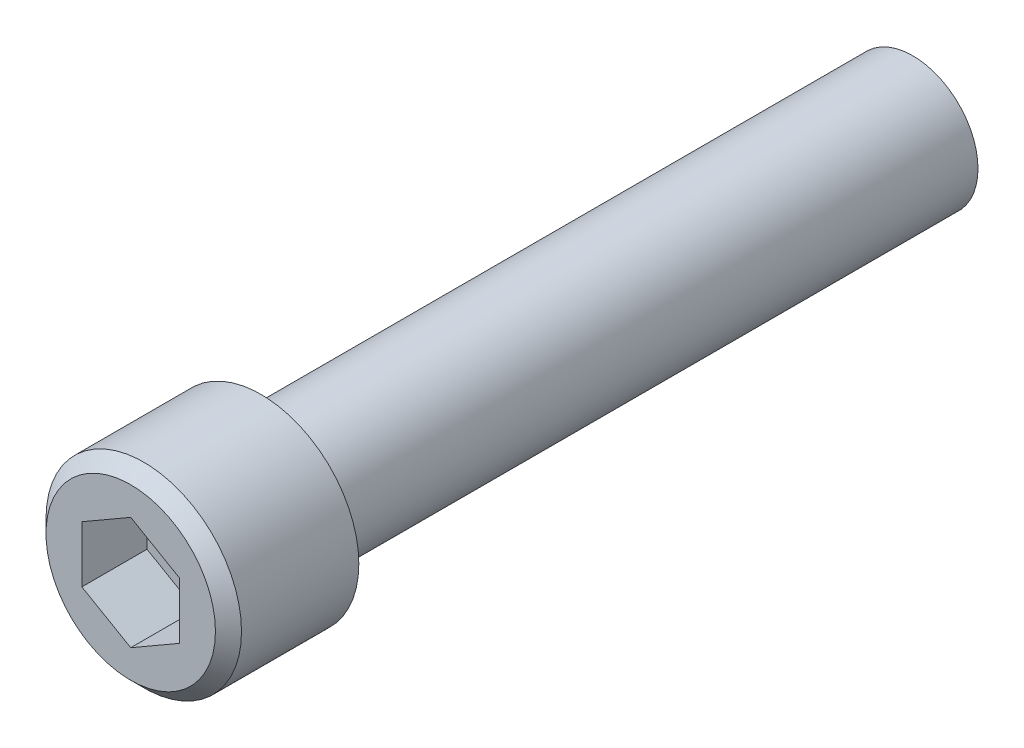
ISO-10303-21;
HEADER;
FILE_DESCRIPTION(('STEP AP214'),'2;1');
FILE_NAME('part.step','',(''),(''),'','','');
FILE_SCHEMA(('AUTOMOTIVE_DESIGN { 1 0 10303 214 1 1 1 1 }'));
ENDSEC;
DATA;
#1=APPLICATION_CONTEXT('core data for automotive mechanical design processes');
#2=APPLICATION_PROTOCOL_DEFINITION('international standard','automotive_design',2000,#1);
#3=PRODUCT_CONTEXT('',#1,'mechanical');
#4=PRODUCT('Part','Part','',(#3));
#5=PRODUCT_RELATED_PRODUCT_CATEGORY('part','',(#4));
#6=PRODUCT_DEFINITION_FORMATION('','',#4);
#7=PRODUCT_DEFINITION_CONTEXT('part definition',#1,'design');
#8=PRODUCT_DEFINITION('design','',#6,#7);
#9=PRODUCT_DEFINITION_SHAPE('','',#8);
#10=(LENGTH_UNIT() NAMED_UNIT(*) SI_UNIT(.MILLI.,.METRE.));
#11=(NAMED_UNIT(*) PLANE_ANGLE_UNIT() SI_UNIT($,.RADIAN.));
#12=(NAMED_UNIT(*) SI_UNIT($,.STERADIAN.) SOLID_ANGLE_UNIT());
#13=UNCERTAINTY_MEASURE_WITH_UNIT(LENGTH_MEASURE(1.E-05),#10,'distance_accuracy_value','');
#14=(GEOMETRIC_REPRESENTATION_CONTEXT(3) GLOBAL_UNCERTAINTY_ASSIGNED_CONTEXT((#13)) GLOBAL_UNIT_ASSIGNED_CONTEXT((#10,
#11,#12)) REPRESENTATION_CONTEXT('',''));
#15=CARTESIAN_POINT('',(0.,0.,0.));
#16=DIRECTION('',(0.,0.,1.));
#17=DIRECTION('',(1.,0.,0.));
#18=AXIS2_PLACEMENT_3D('',#15,#16,#17);
#19=CARTESIAN_POINT('',(0.,0.,31.75));
#20=DIRECTION('',(0.,0.,-1.));
#21=DIRECTION('',(-1.,0.,0.));
#22=AXIS2_PLACEMENT_3D('',#19,#20,#21);
#23=CYLINDRICAL_SURFACE('',#22,3.175);
#24=CARTESIAN_POINT('',(0.,0.,31.3944));
#25=DIRECTION('',(0.,0.,1.));
#26=DIRECTION('',(1.,0.,0.));
#27=AXIS2_PLACEMENT_3D('',#24,#25,#26);
#28=CIRCLE('',#27,3.175);
#29=CARTESIAN_POINT('',(3.175,0.,31.3944));
#30=VERTEX_POINT('',#29);
#31=EDGE_CURVE('E143',#30,#30,#28,.F.);
#32=ORIENTED_EDGE('',*,*,#31,.T.);
#33=EDGE_LOOP('',(#32));
#34=FACE_BOUND('',#33,.T.);
#35=CARTESIAN_POINT('',(0.,0.,0.));
#36=DIRECTION('',(0.,0.,1.));
#37=DIRECTION('',(1.,0.,0.));
#38=AXIS2_PLACEMENT_3D('',#35,#36,#37);
#39=CIRCLE('',#38,3.175);
#40=CARTESIAN_POINT('',(3.175,0.,0.));
#41=VERTEX_POINT('',#40);
#42=EDGE_CURVE('E137',#41,#41,#39,.T.);
#43=ORIENTED_EDGE('',*,*,#42,.T.);
#44=EDGE_LOOP('',(#43));
#45=FACE_BOUND('',#44,.T.);
#46=ADVANCED_FACE('F30',(#34,#45),#23,.T.);
#47=CARTESIAN_POINT('',(0.,0.,0.));
#48=DIRECTION('',(0.,0.,1.));
#49=DIRECTION('',(1.,0.,0.));
#50=AXIS2_PLACEMENT_3D('',#47,#48,#49);
#51=PLANE('',#50);
#52=ORIENTED_EDGE('',*,*,#42,.F.);
#53=EDGE_LOOP('',(#52));
#54=FACE_BOUND('',#53,.T.);
#55=ADVANCED_FACE('F161',(#54),#51,.F.);
#56=CARTESIAN_POINT('',(0.,0.,31.75));
#57=DIRECTION('',(0.,0.,1.));
#58=DIRECTION('',(1.,0.,0.));
#59=AXIS2_PLACEMENT_3D('',#56,#57,#58);
#60=PLANE('',#59);
#61=CARTESIAN_POINT('',(0.,0.,31.75));
#62=DIRECTION('',(0.,0.,1.));
#63=DIRECTION('',(1.,0.,0.));
#64=AXIS2_PLACEMENT_3D('',#61,#62,#63);
#65=CIRCLE('',#64,3.5306);
#66=CARTESIAN_POINT('',(3.5306,0.,31.75));
#67=VERTEX_POINT('',#66);
#68=EDGE_CURVE('E140',#67,#67,#65,.T.);
#69=ORIENTED_EDGE('',*,*,#68,.T.);
#70=EDGE_LOOP('',(#69));
#71=FACE_BOUND('',#70,.T.);
#72=CARTESIAN_POINT('',(0.,0.,31.75));
#73=DIRECTION('',(0.,0.,1.));
#74=DIRECTION('',(1.,0.,0.));
#75=AXIS2_PLACEMENT_3D('',#72,#73,#74);
#76=CIRCLE('',#75,4.7625);
#77=CARTESIAN_POINT('',(4.7625,0.,31.75));
#78=VERTEX_POINT('',#77);
#79=EDGE_CURVE('E128',#78,#78,#76,.T.);
#80=ORIENTED_EDGE('',*,*,#79,.F.);
#81=EDGE_LOOP('',(#80));
#82=FACE_BOUND('',#81,.T.);
#83=ADVANCED_FACE('F166',(#71,#82),#60,.F.);
#84=CARTESIAN_POINT('',(0.,0.,38.1));
#85=DIRECTION('',(0.,0.,-1.));
#86=DIRECTION('',(-1.,0.,0.));
#87=AXIS2_PLACEMENT_3D('',#84,#85,#86);
#88=CYLINDRICAL_SURFACE('',#87,4.7625);
#89=CARTESIAN_POINT('',(0.,0.,37.4649999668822));
#90=DIRECTION('',(0.,0.,1.));
#91=DIRECTION('',(1.,0.,0.));
#92=AXIS2_PLACEMENT_3D('',#89,#90,#91);
#93=CIRCLE('',#92,4.7625);
#94=CARTESIAN_POINT('',(4.7625,0.,37.4649999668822));
#95=VERTEX_POINT('',#94);
#96=EDGE_CURVE('E11',#95,#95,#93,.F.);
#97=ORIENTED_EDGE('',*,*,#96,.T.);
#98=EDGE_LOOP('',(#97));
#99=FACE_BOUND('',#98,.T.);
#100=ORIENTED_EDGE('',*,*,#79,.T.);
#101=EDGE_LOOP('',(#100));
#102=FACE_BOUND('',#101,.T.);
#103=ADVANCED_FACE('F181',(#99,#102),#88,.T.);
#104=CARTESIAN_POINT('',(0.,0.,38.1));
#105=DIRECTION('',(0.,0.,1.));
#106=DIRECTION('',(1.,0.,0.));
#107=AXIS2_PLACEMENT_3D('',#104,#105,#106);
#108=PLANE('',#107);
#109=CARTESIAN_POINT('',(0.,0.,38.1));
#110=DIRECTION('',(0.,0.,1.));
#111=DIRECTION('',(1.,0.,0.));
#112=AXIS2_PLACEMENT_3D('',#109,#110,#111);
#113=CIRCLE('',#112,4.12749996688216);
#114=CARTESIAN_POINT('',(4.12749996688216,0.,38.1));
#115=VERTEX_POINT('',#114);
#116=EDGE_CURVE('E37',#115,#115,#113,.T.);
#117=ORIENTED_EDGE('',*,*,#116,.T.);
#118=EDGE_LOOP('',(#117));
#119=FACE_BOUND('',#118,.T.);
#120=DIRECTION('',(-0.866025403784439,-0.5,0.));
#121=VECTOR('',#120,1.);
#122=CARTESIAN_POINT('',(0.,2.7496306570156,38.1000000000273));
#123=LINE('',#122,#121);
#124=CARTESIAN_POINT('',(0.,2.7496306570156,38.1000000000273));
#125=VERTEX_POINT('',#124);
#126=CARTESIAN_POINT('',(-2.38125,1.3748153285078,38.1));
#127=VERTEX_POINT('',#126);
#128=EDGE_CURVE('E44',#125,#127,#123,.T.);
#129=ORIENTED_EDGE('',*,*,#128,.F.);
#130=DIRECTION('',(0.866025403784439,-0.5,0.));
#131=VECTOR('',#130,1.);
#132=CARTESIAN_POINT('',(0.,2.7496306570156,38.1000000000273));
#133=LINE('',#132,#131);
#134=CARTESIAN_POINT('',(2.38125,1.3748153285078,38.1000000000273));
#135=VERTEX_POINT('',#134);
#136=EDGE_CURVE('E111',#125,#135,#133,.T.);
#137=ORIENTED_EDGE('',*,*,#136,.T.);
#138=DIRECTION('',(0.,-1.,0.));
#139=VECTOR('',#138,1.);
#140=CARTESIAN_POINT('',(2.38125,1.3748153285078,38.1000000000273));
#141=LINE('',#140,#139);
#142=CARTESIAN_POINT('',(2.38125,-1.37481532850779,38.1000000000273));
#143=VERTEX_POINT('',#142);
#144=EDGE_CURVE('E106',#135,#143,#141,.T.);
#145=ORIENTED_EDGE('',*,*,#144,.T.);
#146=DIRECTION('',(0.866025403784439,0.5,0.));
#147=VECTOR('',#146,1.);
#148=CARTESIAN_POINT('',(0.,-2.74963065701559,38.1000000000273));
#149=LINE('',#148,#147);
#150=CARTESIAN_POINT('',(0.,-2.74963065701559,38.1000000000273));
#151=VERTEX_POINT('',#150);
#152=EDGE_CURVE('E104',#151,#143,#149,.T.);
#153=ORIENTED_EDGE('',*,*,#152,.F.);
#154=DIRECTION('',(-0.866025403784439,0.5,0.));
#155=VECTOR('',#154,1.);
#156=CARTESIAN_POINT('',(0.,-2.74963065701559,38.1000000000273));
#157=LINE('',#156,#155);
#158=CARTESIAN_POINT('',(-2.38125,-1.37481532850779,38.1000000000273));
#159=VERTEX_POINT('',#158);
#160=EDGE_CURVE('E86',#151,#159,#157,.T.);
#161=ORIENTED_EDGE('',*,*,#160,.T.);
#162=DIRECTION('',(0.,-1.,0.));
#163=VECTOR('',#162,1.);
#164=CARTESIAN_POINT('',(-2.38125,1.3748153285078,38.1000000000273));
#165=LINE('',#164,#163);
#166=EDGE_CURVE('E97',#127,#159,#165,.T.);
#167=ORIENTED_EDGE('',*,*,#166,.F.);
#168=EDGE_LOOP('',(#129,#137,#145,#153,#161,#167));
#169=FACE_BOUND('',#168,.T.);
#170=ADVANCED_FACE('F101',(#119,#169),#108,.T.);
#171=CARTESIAN_POINT('',(0.,0.,31.3944));
#172=DIRECTION('',(0.,0.,1.));
#173=DIRECTION('',(1.,0.,0.));
#174=AXIS2_PLACEMENT_3D('',#171,#172,#173);
#175=TOROIDAL_SURFACE('',#174,3.5306,0.3556);
#176=ORIENTED_EDGE('',*,*,#31,.F.);
#177=EDGE_LOOP('',(#176));
#178=FACE_BOUND('',#177,.T.);
#179=ORIENTED_EDGE('',*,*,#68,.F.);
#180=EDGE_LOOP('',(#179));
#181=FACE_BOUND('',#180,.T.);
#182=ADVANCED_FACE('F172',(#178,#181),#175,.F.);
#183=CARTESIAN_POINT('',(0.,2.7496306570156,34.9250000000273));
#184=DIRECTION('',(-0.5,0.866025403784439,0.));
#185=DIRECTION('',(-0.866025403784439,-0.5,0.));
#186=AXIS2_PLACEMENT_3D('',#183,#184,#185);
#187=PLANE('',#186);
#188=ORIENTED_EDGE('',*,*,#128,.T.);
#189=DIRECTION('',(0.,0.,1.));
#190=VECTOR('',#189,1.);
#191=CARTESIAN_POINT('',(-2.38125,1.3748153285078,34.9250000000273));
#192=LINE('',#191,#190);
#193=CARTESIAN_POINT('',(-2.38125,1.3748153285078,34.9250000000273));
#194=VERTEX_POINT('',#193);
#195=EDGE_CURVE('E94',#194,#127,#192,.T.);
#196=ORIENTED_EDGE('',*,*,#195,.F.);
#197=DIRECTION('',(-0.866025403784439,-0.5,0.));
#198=VECTOR('',#197,1.);
#199=CARTESIAN_POINT('',(0.,2.7496306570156,34.9250000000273));
#200=LINE('',#199,#198);
#201=CARTESIAN_POINT('',(0.,2.7496306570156,34.9250000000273));
#202=VERTEX_POINT('',#201);
#203=EDGE_CURVE('E114',#202,#194,#200,.T.);
#204=ORIENTED_EDGE('',*,*,#203,.F.);
#205=DIRECTION('',(0.,0.,1.));
#206=VECTOR('',#205,1.);
#207=CARTESIAN_POINT('',(0.,2.7496306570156,34.9250000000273));
#208=LINE('',#207,#206);
#209=EDGE_CURVE('E51',#202,#125,#208,.T.);
#210=ORIENTED_EDGE('',*,*,#209,.T.);
#211=EDGE_LOOP('',(#188,#196,#204,#210));
#212=FACE_BOUND('',#211,.T.);
#213=ADVANCED_FACE('F175',(#212),#187,.F.);
#214=CARTESIAN_POINT('',(0.,2.7496306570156,34.9250000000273));
#215=DIRECTION('',(-0.5,-0.866025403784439,0.));
#216=DIRECTION('',(0.866025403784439,-0.5,0.));
#217=AXIS2_PLACEMENT_3D('',#214,#215,#216);
#218=PLANE('',#217);
#219=ORIENTED_EDGE('',*,*,#136,.F.);
#220=ORIENTED_EDGE('',*,*,#209,.F.);
#221=DIRECTION('',(0.866025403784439,-0.5,0.));
#222=VECTOR('',#221,1.);
#223=CARTESIAN_POINT('',(0.,2.7496306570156,34.9250000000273));
#224=LINE('',#223,#222);
#225=CARTESIAN_POINT('',(2.38125,1.3748153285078,34.9250000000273));
#226=VERTEX_POINT('',#225);
#227=EDGE_CURVE('E125',#202,#226,#224,.T.);
#228=ORIENTED_EDGE('',*,*,#227,.T.);
#229=DIRECTION('',(0.,0.,1.));
#230=VECTOR('',#229,1.);
#231=CARTESIAN_POINT('',(2.38125,1.3748153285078,34.9250000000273));
#232=LINE('',#231,#230);
#233=EDGE_CURVE('E129',#226,#135,#232,.T.);
#234=ORIENTED_EDGE('',*,*,#233,.T.);
#235=EDGE_LOOP('',(#219,#220,#228,#234));
#236=FACE_BOUND('',#235,.T.);
#237=ADVANCED_FACE('F195',(#236),#218,.T.);
#238=CARTESIAN_POINT('',(2.38125,1.3748153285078,34.9250000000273));
#239=DIRECTION('',(-1.,0.,0.));
#240=DIRECTION('',(0.,-1.,0.));
#241=AXIS2_PLACEMENT_3D('',#238,#239,#240);
#242=PLANE('',#241);
#243=ORIENTED_EDGE('',*,*,#144,.F.);
#244=ORIENTED_EDGE('',*,*,#233,.F.);
#245=DIRECTION('',(0.,-1.,0.));
#246=VECTOR('',#245,1.);
#247=CARTESIAN_POINT('',(2.38125,1.3748153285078,34.9250000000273));
#248=LINE('',#247,#246);
#249=CARTESIAN_POINT('',(2.38125,-1.37481532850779,34.9250000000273));
#250=VERTEX_POINT('',#249);
#251=EDGE_CURVE('E123',#226,#250,#248,.T.);
#252=ORIENTED_EDGE('',*,*,#251,.T.);
#253=DIRECTION('',(0.,0.,1.));
#254=VECTOR('',#253,1.);
#255=CARTESIAN_POINT('',(2.38125,-1.37481532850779,34.9250000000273));
#256=LINE('',#255,#254);
#257=EDGE_CURVE('E131',#250,#143,#256,.T.);
#258=ORIENTED_EDGE('',*,*,#257,.T.);
#259=EDGE_LOOP('',(#243,#244,#252,#258));
#260=FACE_BOUND('',#259,.T.);
#261=ADVANCED_FACE('F203',(#260),#242,.T.);
#262=CARTESIAN_POINT('',(0.,-2.74963065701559,34.9250000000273));
#263=DIRECTION('',(0.5,-0.866025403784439,0.));
#264=DIRECTION('',(0.866025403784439,0.5,0.));
#265=AXIS2_PLACEMENT_3D('',#262,#263,#264);
#266=PLANE('',#265);
#267=ORIENTED_EDGE('',*,*,#152,.T.);
#268=ORIENTED_EDGE('',*,*,#257,.F.);
#269=DIRECTION('',(0.866025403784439,0.5,0.));
#270=VECTOR('',#269,1.);
#271=CARTESIAN_POINT('',(0.,-2.74963065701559,34.9250000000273));
#272=LINE('',#271,#270);
#273=CARTESIAN_POINT('',(0.,-2.74963065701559,34.9250000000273));
#274=VERTEX_POINT('',#273);
#275=EDGE_CURVE('E120',#274,#250,#272,.T.);
#276=ORIENTED_EDGE('',*,*,#275,.F.);
#277=DIRECTION('',(0.,0.,1.));
#278=VECTOR('',#277,1.);
#279=CARTESIAN_POINT('',(0.,-2.74963065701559,34.9250000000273));
#280=LINE('',#279,#278);
#281=EDGE_CURVE('E93',#274,#151,#280,.T.);
#282=ORIENTED_EDGE('',*,*,#281,.T.);
#283=EDGE_LOOP('',(#267,#268,#276,#282));
#284=FACE_BOUND('',#283,.T.);
#285=ADVANCED_FACE('F200',(#284),#266,.F.);
#286=CARTESIAN_POINT('',(0.,-2.74963065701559,34.9250000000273));
#287=DIRECTION('',(0.5,0.866025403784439,0.));
#288=DIRECTION('',(-0.866025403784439,0.5,0.));
#289=AXIS2_PLACEMENT_3D('',#286,#287,#288);
#290=PLANE('',#289);
#291=ORIENTED_EDGE('',*,*,#160,.F.);
#292=ORIENTED_EDGE('',*,*,#281,.F.);
#293=DIRECTION('',(-0.866025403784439,0.5,0.));
#294=VECTOR('',#293,1.);
#295=CARTESIAN_POINT('',(0.,-2.74963065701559,34.9250000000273));
#296=LINE('',#295,#294);
#297=CARTESIAN_POINT('',(-2.38125,-1.37481532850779,34.9250000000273));
#298=VERTEX_POINT('',#297);
#299=EDGE_CURVE('E89',#274,#298,#296,.T.);
#300=ORIENTED_EDGE('',*,*,#299,.T.);
#301=DIRECTION('',(0.,0.,1.));
#302=VECTOR('',#301,1.);
#303=CARTESIAN_POINT('',(-2.38125,-1.37481532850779,34.9250000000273));
#304=LINE('',#303,#302);
#305=EDGE_CURVE('E82',#298,#159,#304,.T.);
#306=ORIENTED_EDGE('',*,*,#305,.T.);
#307=EDGE_LOOP('',(#291,#292,#300,#306));
#308=FACE_BOUND('',#307,.T.);
#309=ADVANCED_FACE('F84',(#308),#290,.T.);
#310=CARTESIAN_POINT('',(-2.38125,1.3748153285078,34.9250000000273));
#311=DIRECTION('',(-1.,0.,0.));
#312=DIRECTION('',(0.,0.,1.));
#313=AXIS2_PLACEMENT_3D('',#310,#311,#312);
#314=PLANE('',#313);
#315=ORIENTED_EDGE('',*,*,#166,.T.);
#316=ORIENTED_EDGE('',*,*,#305,.F.);
#317=DIRECTION('',(0.,-1.,0.));
#318=VECTOR('',#317,1.);
#319=CARTESIAN_POINT('',(-2.38125,1.3748153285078,34.9250000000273));
#320=LINE('',#319,#318);
#321=EDGE_CURVE('E117',#194,#298,#320,.T.);
#322=ORIENTED_EDGE('',*,*,#321,.F.);
#323=ORIENTED_EDGE('',*,*,#195,.T.);
#324=EDGE_LOOP('',(#315,#316,#322,#323));
#325=FACE_BOUND('',#324,.T.);
#326=ADVANCED_FACE('F98',(#325),#314,.F.);
#327=CARTESIAN_POINT('',(-4.7625,0.,34.9250000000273));
#328=DIRECTION('',(0.,0.,-1.));
#329=DIRECTION('',(-1.,0.,0.));
#330=AXIS2_PLACEMENT_3D('',#327,#328,#329);
#331=PLANE('',#330);
#332=ORIENTED_EDGE('',*,*,#203,.T.);
#333=ORIENTED_EDGE('',*,*,#321,.T.);
#334=ORIENTED_EDGE('',*,*,#299,.F.);
#335=ORIENTED_EDGE('',*,*,#275,.T.);
#336=ORIENTED_EDGE('',*,*,#251,.F.);
#337=ORIENTED_EDGE('',*,*,#227,.F.);
#338=EDGE_LOOP('',(#332,#333,#334,#335,#336,#337));
#339=FACE_BOUND('',#338,.T.);
#340=ADVANCED_FACE('F151',(#339),#331,.F.);
#341=CARTESIAN_POINT('',(0.,0.,38.1));
#342=DIRECTION('',(0.,0.,-1.));
#343=DIRECTION('',(-1.,0.,0.));
#344=AXIS2_PLACEMENT_3D('',#341,#342,#343);
#345=CONICAL_SURFACE('',#344,4.12749996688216,0.785398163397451);
#346=ORIENTED_EDGE('',*,*,#96,.F.);
#347=EDGE_LOOP('',(#346));
#348=FACE_BOUND('',#347,.T.);
#349=ORIENTED_EDGE('',*,*,#116,.F.);
#350=EDGE_LOOP('',(#349));
#351=FACE_BOUND('',#350,.T.);
#352=ADVANCED_FACE('F149',(#348,#351),#345,.T.);
#353=CLOSED_SHELL('',(#46,#55,#83,#103,#170,#182,#213,#237,#261,#285,#309,#326,#340,#352));
#354=MANIFOLD_SOLID_BREP('B2',#353);
#355=ADVANCED_BREP_SHAPE_REPRESENTATION('',(#18,#354),#14);
#356=SHAPE_DEFINITION_REPRESENTATION(#9,#355);
ENDSEC;
END-ISO-10303-21;
